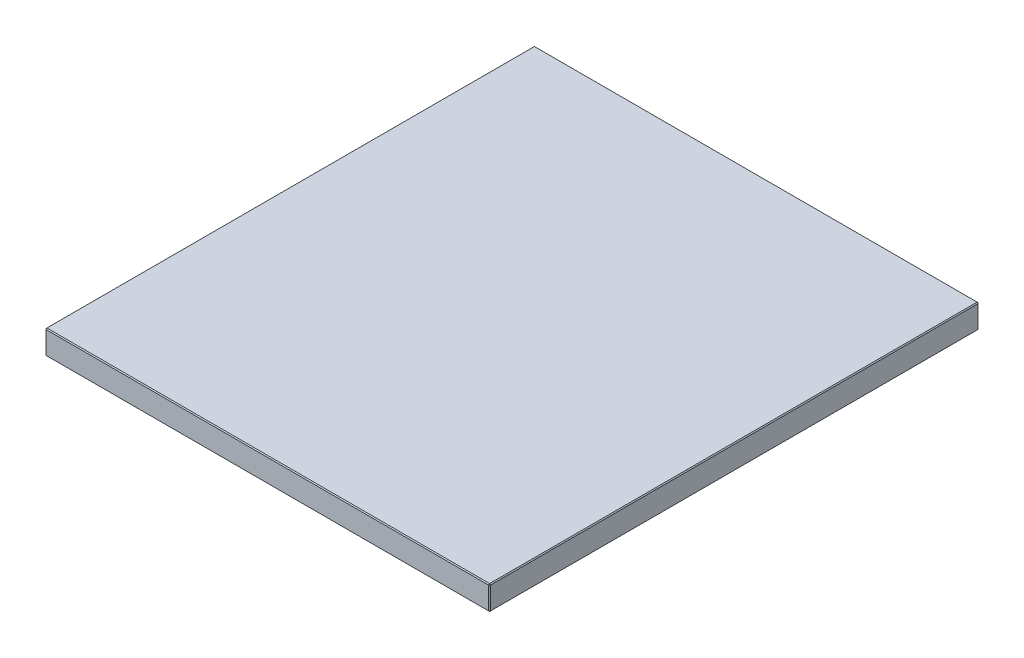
ISO-10303-21;
HEADER;
FILE_DESCRIPTION(('STEP AP214'),'2;1');
FILE_NAME('part.step','',(''),(''),'','','');
FILE_SCHEMA(('AUTOMOTIVE_DESIGN { 1 0 10303 214 1 1 1 1 }'));
ENDSEC;
DATA;
#1=APPLICATION_CONTEXT('core data for automotive mechanical design processes');
#2=APPLICATION_PROTOCOL_DEFINITION('international standard','automotive_design',2000,#1);
#3=PRODUCT_CONTEXT('',#1,'mechanical');
#4=PRODUCT('Part','Part','',(#3));
#5=PRODUCT_RELATED_PRODUCT_CATEGORY('part','',(#4));
#6=PRODUCT_DEFINITION_FORMATION('','',#4);
#7=PRODUCT_DEFINITION_CONTEXT('part definition',#1,'design');
#8=PRODUCT_DEFINITION('design','',#6,#7);
#9=PRODUCT_DEFINITION_SHAPE('','',#8);
#10=(LENGTH_UNIT() NAMED_UNIT(*) SI_UNIT(.MILLI.,.METRE.));
#11=(NAMED_UNIT(*) PLANE_ANGLE_UNIT() SI_UNIT($,.RADIAN.));
#12=(NAMED_UNIT(*) SI_UNIT($,.STERADIAN.) SOLID_ANGLE_UNIT());
#13=UNCERTAINTY_MEASURE_WITH_UNIT(LENGTH_MEASURE(1.E-05),#10,'distance_accuracy_value','');
#14=(GEOMETRIC_REPRESENTATION_CONTEXT(3) GLOBAL_UNCERTAINTY_ASSIGNED_CONTEXT((#13)) GLOBAL_UNIT_ASSIGNED_CONTEXT((#10,
#11,#12)) REPRESENTATION_CONTEXT('',''));
#15=CARTESIAN_POINT('',(0.,0.,0.));
#16=DIRECTION('',(0.,0.,1.));
#17=DIRECTION('',(1.,0.,0.));
#18=AXIS2_PLACEMENT_3D('',#15,#16,#17);
#19=CARTESIAN_POINT('',(-248.,27.,273.));
#20=DIRECTION('',(1.,0.,0.));
#21=DIRECTION('',(0.,0.,-1.));
#22=AXIS2_PLACEMENT_3D('',#19,#20,#21);
#23=PLANE('',#22);
#24=DIRECTION('',(0.,-1.,0.));
#25=VECTOR('',#24,1.);
#26=CARTESIAN_POINT('',(-248.,27.,-272.));
#27=LINE('',#26,#25);
#28=CARTESIAN_POINT('',(-248.,26.,-272.));
#29=VERTEX_POINT('',#28);
#30=CARTESIAN_POINT('',(-248.,1.,-272.));
#31=VERTEX_POINT('',#30);
#32=EDGE_CURVE('E114',#29,#31,#27,.T.);
#33=ORIENTED_EDGE('',*,*,#32,.T.);
#34=DIRECTION('',(0.,0.,1.));
#35=VECTOR('',#34,1.);
#36=CARTESIAN_POINT('',(-248.,1.,273.));
#37=LINE('',#36,#35);
#38=CARTESIAN_POINT('',(-248.,1.,272.));
#39=VERTEX_POINT('',#38);
#40=EDGE_CURVE('E110',#31,#39,#37,.T.);
#41=ORIENTED_EDGE('',*,*,#40,.T.);
#42=DIRECTION('',(0.,1.,0.));
#43=VECTOR('',#42,1.);
#44=CARTESIAN_POINT('',(-248.,27.,272.));
#45=LINE('',#44,#43);
#46=CARTESIAN_POINT('',(-248.,26.,272.));
#47=VERTEX_POINT('',#46);
#48=EDGE_CURVE('E103',#39,#47,#45,.T.);
#49=ORIENTED_EDGE('',*,*,#48,.T.);
#50=DIRECTION('',(0.,0.,-1.));
#51=VECTOR('',#50,1.);
#52=CARTESIAN_POINT('',(-248.,26.,-273.));
#53=LINE('',#52,#51);
#54=EDGE_CURVE('E107',#47,#29,#53,.T.);
#55=ORIENTED_EDGE('',*,*,#54,.T.);
#56=EDGE_LOOP('',(#33,#41,#49,#55));
#57=FACE_BOUND('',#56,.T.);
#58=ADVANCED_FACE('F15',(#57),#23,.F.);
#59=CARTESIAN_POINT('',(248.,27.,273.));
#60=DIRECTION('',(0.,0.,-1.));
#61=DIRECTION('',(-1.,0.,0.));
#62=AXIS2_PLACEMENT_3D('',#59,#60,#61);
#63=PLANE('',#62);
#64=DIRECTION('',(-1.,0.,0.));
#65=VECTOR('',#64,1.);
#66=CARTESIAN_POINT('',(-248.,26.,273.));
#67=LINE('',#66,#65);
#68=CARTESIAN_POINT('',(247.,26.,273.));
#69=VERTEX_POINT('',#68);
#70=CARTESIAN_POINT('',(-247.,26.,273.));
#71=VERTEX_POINT('',#70);
#72=EDGE_CURVE('E164',#69,#71,#67,.T.);
#73=ORIENTED_EDGE('',*,*,#72,.T.);
#74=DIRECTION('',(0.,-1.,0.));
#75=VECTOR('',#74,1.);
#76=CARTESIAN_POINT('',(-247.,27.,273.));
#77=LINE('',#76,#75);
#78=CARTESIAN_POINT('',(-247.,1.,273.));
#79=VERTEX_POINT('',#78);
#80=EDGE_CURVE('E122',#71,#79,#77,.T.);
#81=ORIENTED_EDGE('',*,*,#80,.T.);
#82=DIRECTION('',(1.,0.,0.));
#83=VECTOR('',#82,1.);
#84=CARTESIAN_POINT('',(248.,1.,273.));
#85=LINE('',#84,#83);
#86=CARTESIAN_POINT('',(247.,1.,273.));
#87=VERTEX_POINT('',#86);
#88=EDGE_CURVE('E168',#79,#87,#85,.T.);
#89=ORIENTED_EDGE('',*,*,#88,.T.);
#90=DIRECTION('',(0.,1.,0.));
#91=VECTOR('',#90,1.);
#92=CARTESIAN_POINT('',(247.,27.,273.));
#93=LINE('',#92,#91);
#94=EDGE_CURVE('E166',#87,#69,#93,.T.);
#95=ORIENTED_EDGE('',*,*,#94,.T.);
#96=EDGE_LOOP('',(#73,#81,#89,#95));
#97=FACE_BOUND('',#96,.T.);
#98=ADVANCED_FACE('F275',(#97),#63,.F.);
#99=CARTESIAN_POINT('',(248.,27.,273.));
#100=DIRECTION('',(-1.,0.,0.));
#101=DIRECTION('',(0.,0.,1.));
#102=AXIS2_PLACEMENT_3D('',#99,#100,#101);
#103=PLANE('',#102);
#104=DIRECTION('',(0.,0.,-1.));
#105=VECTOR('',#104,1.);
#106=CARTESIAN_POINT('',(248.,1.,273.));
#107=LINE('',#106,#105);
#108=CARTESIAN_POINT('',(248.,1.,272.));
#109=VERTEX_POINT('',#108);
#110=CARTESIAN_POINT('',(248.,1.,-272.));
#111=VERTEX_POINT('',#110);
#112=EDGE_CURVE('E159',#109,#111,#107,.T.);
#113=ORIENTED_EDGE('',*,*,#112,.T.);
#114=DIRECTION('',(0.,1.,0.));
#115=VECTOR('',#114,1.);
#116=CARTESIAN_POINT('',(248.,27.,-272.));
#117=LINE('',#116,#115);
#118=CARTESIAN_POINT('',(248.,26.,-272.));
#119=VERTEX_POINT('',#118);
#120=EDGE_CURVE('E161',#111,#119,#117,.T.);
#121=ORIENTED_EDGE('',*,*,#120,.T.);
#122=DIRECTION('',(0.,0.,1.));
#123=VECTOR('',#122,1.);
#124=CARTESIAN_POINT('',(248.,26.,273.));
#125=LINE('',#124,#123);
#126=CARTESIAN_POINT('',(248.,26.,272.));
#127=VERTEX_POINT('',#126);
#128=EDGE_CURVE('E155',#119,#127,#125,.T.);
#129=ORIENTED_EDGE('',*,*,#128,.T.);
#130=DIRECTION('',(0.,-1.,0.));
#131=VECTOR('',#130,1.);
#132=CARTESIAN_POINT('',(248.,27.,272.));
#133=LINE('',#132,#131);
#134=EDGE_CURVE('E157',#127,#109,#133,.T.);
#135=ORIENTED_EDGE('',*,*,#134,.T.);
#136=EDGE_LOOP('',(#113,#121,#129,#135));
#137=FACE_BOUND('',#136,.T.);
#138=ADVANCED_FACE('F254',(#137),#103,.F.);
#139=CARTESIAN_POINT('',(248.,27.,-273.));
#140=DIRECTION('',(0.,0.,1.));
#141=DIRECTION('',(1.,0.,0.));
#142=AXIS2_PLACEMENT_3D('',#139,#140,#141);
#143=PLANE('',#142);
#144=DIRECTION('',(0.,-1.,0.));
#145=VECTOR('',#144,1.);
#146=CARTESIAN_POINT('',(247.,27.,-273.));
#147=LINE('',#146,#145);
#148=CARTESIAN_POINT('',(247.,26.,-273.));
#149=VERTEX_POINT('',#148);
#150=CARTESIAN_POINT('',(247.,1.,-273.));
#151=VERTEX_POINT('',#150);
#152=EDGE_CURVE('E148',#149,#151,#147,.T.);
#153=ORIENTED_EDGE('',*,*,#152,.T.);
#154=DIRECTION('',(-1.,0.,0.));
#155=VECTOR('',#154,1.);
#156=CARTESIAN_POINT('',(248.,1.,-273.));
#157=LINE('',#156,#155);
#158=CARTESIAN_POINT('',(-247.,1.,-273.));
#159=VERTEX_POINT('',#158);
#160=EDGE_CURVE('E153',#151,#159,#157,.T.);
#161=ORIENTED_EDGE('',*,*,#160,.T.);
#162=DIRECTION('',(0.,1.,0.));
#163=VECTOR('',#162,1.);
#164=CARTESIAN_POINT('',(-247.,27.,-273.));
#165=LINE('',#164,#163);
#166=CARTESIAN_POINT('',(-247.,26.,-273.));
#167=VERTEX_POINT('',#166);
#168=EDGE_CURVE('E150',#159,#167,#165,.T.);
#169=ORIENTED_EDGE('',*,*,#168,.T.);
#170=DIRECTION('',(1.,0.,0.));
#171=VECTOR('',#170,1.);
#172=CARTESIAN_POINT('',(248.,26.,-273.));
#173=LINE('',#172,#171);
#174=EDGE_CURVE('E146',#167,#149,#173,.T.);
#175=ORIENTED_EDGE('',*,*,#174,.T.);
#176=EDGE_LOOP('',(#153,#161,#169,#175));
#177=FACE_BOUND('',#176,.T.);
#178=ADVANCED_FACE('F284',(#177),#143,.F.);
#179=CARTESIAN_POINT('',(0.,27.,0.));
#180=DIRECTION('',(0.,1.,0.));
#181=DIRECTION('',(0.,0.,1.));
#182=AXIS2_PLACEMENT_3D('',#179,#180,#181);
#183=PLANE('',#182);
#184=DIRECTION('',(0.,0.,-1.));
#185=VECTOR('',#184,1.);
#186=CARTESIAN_POINT('',(247.,27.,-273.));
#187=LINE('',#186,#185);
#188=CARTESIAN_POINT('',(247.,27.,272.));
#189=VERTEX_POINT('',#188);
#190=CARTESIAN_POINT('',(247.,27.,-272.));
#191=VERTEX_POINT('',#190);
#192=EDGE_CURVE('E24',#189,#191,#187,.T.);
#193=ORIENTED_EDGE('',*,*,#192,.T.);
#194=DIRECTION('',(-1.,0.,0.));
#195=VECTOR('',#194,1.);
#196=CARTESIAN_POINT('',(-248.,27.,-272.));
#197=LINE('',#196,#195);
#198=CARTESIAN_POINT('',(-247.,27.,-272.));
#199=VERTEX_POINT('',#198);
#200=EDGE_CURVE('E9',#191,#199,#197,.T.);
#201=ORIENTED_EDGE('',*,*,#200,.T.);
#202=DIRECTION('',(0.,0.,1.));
#203=VECTOR('',#202,1.);
#204=CARTESIAN_POINT('',(-247.,27.,273.));
#205=LINE('',#204,#203);
#206=CARTESIAN_POINT('',(-247.,27.,272.));
#207=VERTEX_POINT('',#206);
#208=EDGE_CURVE('E180',#199,#207,#205,.T.);
#209=ORIENTED_EDGE('',*,*,#208,.T.);
#210=DIRECTION('',(1.,0.,0.));
#211=VECTOR('',#210,1.);
#212=CARTESIAN_POINT('',(248.,27.,272.));
#213=LINE('',#212,#211);
#214=EDGE_CURVE('E35',#207,#189,#213,.T.);
#215=ORIENTED_EDGE('',*,*,#214,.T.);
#216=EDGE_LOOP('',(#193,#201,#209,#215));
#217=FACE_BOUND('',#216,.T.);
#218=ADVANCED_FACE('F350',(#217),#183,.T.);
#219=CARTESIAN_POINT('',(0.,0.,0.));
#220=DIRECTION('',(0.,1.,0.));
#221=DIRECTION('',(0.,0.,1.));
#222=AXIS2_PLACEMENT_3D('',#219,#220,#221);
#223=PLANE('',#222);
#224=DIRECTION('',(0.,0.,1.));
#225=VECTOR('',#224,1.);
#226=CARTESIAN_POINT('',(247.,0.,0.));
#227=LINE('',#226,#225);
#228=CARTESIAN_POINT('',(247.,0.,-272.));
#229=VERTEX_POINT('',#228);
#230=CARTESIAN_POINT('',(247.,0.,272.));
#231=VERTEX_POINT('',#230);
#232=EDGE_CURVE('E171',#229,#231,#227,.T.);
#233=ORIENTED_EDGE('',*,*,#232,.T.);
#234=DIRECTION('',(-1.,0.,0.));
#235=VECTOR('',#234,1.);
#236=CARTESIAN_POINT('',(0.,0.,272.));
#237=LINE('',#236,#235);
#238=CARTESIAN_POINT('',(-247.,0.,272.));
#239=VERTEX_POINT('',#238);
#240=EDGE_CURVE('E177',#231,#239,#237,.T.);
#241=ORIENTED_EDGE('',*,*,#240,.T.);
#242=DIRECTION('',(0.,0.,-1.));
#243=VECTOR('',#242,1.);
#244=CARTESIAN_POINT('',(-247.,0.,0.));
#245=LINE('',#244,#243);
#246=CARTESIAN_POINT('',(-247.,0.,-272.));
#247=VERTEX_POINT('',#246);
#248=EDGE_CURVE('E175',#239,#247,#245,.T.);
#249=ORIENTED_EDGE('',*,*,#248,.T.);
#250=DIRECTION('',(1.,0.,0.));
#251=VECTOR('',#250,1.);
#252=CARTESIAN_POINT('',(0.,0.,-272.));
#253=LINE('',#252,#251);
#254=EDGE_CURVE('E173',#247,#229,#253,.T.);
#255=ORIENTED_EDGE('',*,*,#254,.T.);
#256=EDGE_LOOP('',(#233,#241,#249,#255));
#257=FACE_BOUND('',#256,.T.);
#258=ADVANCED_FACE('F246',(#257),#223,.F.);
#259=CARTESIAN_POINT('',(248.,27.,272.));
#260=DIRECTION('',(-0.707106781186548,0.,-0.707106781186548));
#261=DIRECTION('',(0.,-1.,0.));
#262=AXIS2_PLACEMENT_3D('',#259,#260,#261);
#263=PLANE('',#262);
#264=DIRECTION('',(-0.707106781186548,0.,0.707106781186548));
#265=VECTOR('',#264,1.);
#266=CARTESIAN_POINT('',(247.,26.,273.));
#267=LINE('',#266,#265);
#268=EDGE_CURVE('E19',#69,#127,#267,.F.);
#269=ORIENTED_EDGE('',*,*,#268,.F.);
#270=ORIENTED_EDGE('',*,*,#94,.F.);
#271=DIRECTION('',(0.707106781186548,0.,-0.707106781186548));
#272=VECTOR('',#271,1.);
#273=CARTESIAN_POINT('',(247.,1.,273.));
#274=LINE('',#273,#272);
#275=EDGE_CURVE('E142',#109,#87,#274,.F.);
#276=ORIENTED_EDGE('',*,*,#275,.F.);
#277=ORIENTED_EDGE('',*,*,#134,.F.);
#278=EDGE_LOOP('',(#269,#270,#276,#277));
#279=FACE_BOUND('',#278,.T.);
#280=ADVANCED_FACE('F17',(#279),#263,.F.);
#281=CARTESIAN_POINT('',(247.,26.,273.));
#282=DIRECTION('',(0.577350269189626,0.577350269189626,0.577350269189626));
#283=DIRECTION('',(0.707106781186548,0.,-0.707106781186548));
#284=AXIS2_PLACEMENT_3D('',#281,#282,#283);
#285=PLANE('',#284);
#286=DIRECTION('',(0.,-0.707106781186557,0.707106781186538));
#287=VECTOR('',#286,1.);
#288=CARTESIAN_POINT('',(247.,26.,273.));
#289=LINE('',#288,#287);
#290=EDGE_CURVE('E226',#69,#189,#289,.F.);
#291=ORIENTED_EDGE('',*,*,#290,.F.);
#292=ORIENTED_EDGE('',*,*,#268,.T.);
#293=DIRECTION('',(-0.707106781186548,0.707106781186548,0.));
#294=VECTOR('',#293,1.);
#295=CARTESIAN_POINT('',(247.5,26.5,272.));
#296=LINE('',#295,#294);
#297=EDGE_CURVE('E228',#189,#127,#296,.F.);
#298=ORIENTED_EDGE('',*,*,#297,.F.);
#299=EDGE_LOOP('',(#291,#292,#298));
#300=FACE_BOUND('',#299,.T.);
#301=ADVANCED_FACE('F270',(#300),#285,.T.);
#302=CARTESIAN_POINT('',(247.,1.,273.));
#303=DIRECTION('',(0.577350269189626,-0.577350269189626,0.577350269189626));
#304=DIRECTION('',(0.707106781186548,0.,-0.707106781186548));
#305=AXIS2_PLACEMENT_3D('',#302,#303,#304);
#306=PLANE('',#305);
#307=DIRECTION('',(-0.707106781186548,-0.707106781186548,0.));
#308=VECTOR('',#307,1.);
#309=CARTESIAN_POINT('',(247.5,0.5,272.));
#310=LINE('',#309,#308);
#311=EDGE_CURVE('E220',#109,#231,#310,.T.);
#312=ORIENTED_EDGE('',*,*,#311,.F.);
#313=ORIENTED_EDGE('',*,*,#275,.T.);
#314=DIRECTION('',(0.,0.707106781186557,0.707106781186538));
#315=VECTOR('',#314,1.);
#316=CARTESIAN_POINT('',(247.,1.,273.));
#317=LINE('',#316,#315);
#318=EDGE_CURVE('E223',#231,#87,#317,.T.);
#319=ORIENTED_EDGE('',*,*,#318,.F.);
#320=EDGE_LOOP('',(#312,#313,#319));
#321=FACE_BOUND('',#320,.T.);
#322=ADVANCED_FACE('F235',(#321),#306,.T.);
#323=CARTESIAN_POINT('',(247.,27.,0.));
#324=DIRECTION('',(0.707106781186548,0.707106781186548,0.));
#325=DIRECTION('',(0.,0.,1.));
#326=AXIS2_PLACEMENT_3D('',#323,#324,#325);
#327=PLANE('',#326);
#328=ORIENTED_EDGE('',*,*,#297,.T.);
#329=ORIENTED_EDGE('',*,*,#128,.F.);
#330=DIRECTION('',(0.707106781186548,-0.707106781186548,0.));
#331=VECTOR('',#330,1.);
#332=CARTESIAN_POINT('',(248.,26.,-272.));
#333=LINE('',#332,#331);
#334=EDGE_CURVE('E215',#191,#119,#333,.T.);
#335=ORIENTED_EDGE('',*,*,#334,.F.);
#336=ORIENTED_EDGE('',*,*,#192,.F.);
#337=EDGE_LOOP('',(#328,#329,#335,#336));
#338=FACE_BOUND('',#337,.T.);
#339=ADVANCED_FACE('F265',(#338),#327,.T.);
#340=CARTESIAN_POINT('',(0.,27.,272.));
#341=DIRECTION('',(0.,0.707106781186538,0.707106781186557));
#342=DIRECTION('',(-1.,0.,0.));
#343=AXIS2_PLACEMENT_3D('',#340,#341,#342);
#344=PLANE('',#343);
#345=ORIENTED_EDGE('',*,*,#290,.T.);
#346=ORIENTED_EDGE('',*,*,#214,.F.);
#347=DIRECTION('',(0.,0.707106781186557,-0.707106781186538));
#348=VECTOR('',#347,1.);
#349=CARTESIAN_POINT('',(-247.,26.5,272.5));
#350=LINE('',#349,#348);
#351=EDGE_CURVE('E126',#71,#207,#350,.T.);
#352=ORIENTED_EDGE('',*,*,#351,.F.);
#353=ORIENTED_EDGE('',*,*,#72,.F.);
#354=EDGE_LOOP('',(#345,#346,#352,#353));
#355=FACE_BOUND('',#354,.T.);
#356=ADVANCED_FACE('F273',(#355),#344,.T.);
#357=CARTESIAN_POINT('',(-247.,27.,273.));
#358=DIRECTION('',(0.707106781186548,0.,-0.707106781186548));
#359=DIRECTION('',(0.,-1.,0.));
#360=AXIS2_PLACEMENT_3D('',#357,#358,#359);
#361=PLANE('',#360);
#362=DIRECTION('',(0.707106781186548,0.,0.707106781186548));
#363=VECTOR('',#362,1.);
#364=CARTESIAN_POINT('',(-247.,1.,273.));
#365=LINE('',#364,#363);
#366=EDGE_CURVE('E127',#79,#39,#365,.F.);
#367=ORIENTED_EDGE('',*,*,#366,.F.);
#368=ORIENTED_EDGE('',*,*,#80,.F.);
#369=DIRECTION('',(-0.707106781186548,0.,-0.707106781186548));
#370=VECTOR('',#369,1.);
#371=CARTESIAN_POINT('',(-248.,26.,272.));
#372=LINE('',#371,#370);
#373=EDGE_CURVE('E118',#47,#71,#372,.F.);
#374=ORIENTED_EDGE('',*,*,#373,.F.);
#375=ORIENTED_EDGE('',*,*,#48,.F.);
#376=EDGE_LOOP('',(#367,#368,#374,#375));
#377=FACE_BOUND('',#376,.T.);
#378=ADVANCED_FACE('F120',(#377),#361,.F.);
#379=CARTESIAN_POINT('',(248.,1.,273.));
#380=DIRECTION('',(0.,0.707106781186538,-0.707106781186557));
#381=DIRECTION('',(1.,0.,0.));
#382=AXIS2_PLACEMENT_3D('',#379,#380,#381);
#383=PLANE('',#382);
#384=ORIENTED_EDGE('',*,*,#318,.T.);
#385=ORIENTED_EDGE('',*,*,#88,.F.);
#386=DIRECTION('',(0.,-0.707106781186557,-0.707106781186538));
#387=VECTOR('',#386,1.);
#388=CARTESIAN_POINT('',(-247.,1.,273.));
#389=LINE('',#388,#387);
#390=EDGE_CURVE('E211',#239,#79,#389,.F.);
#391=ORIENTED_EDGE('',*,*,#390,.F.);
#392=ORIENTED_EDGE('',*,*,#240,.F.);
#393=EDGE_LOOP('',(#384,#385,#391,#392));
#394=FACE_BOUND('',#393,.T.);
#395=ADVANCED_FACE('F243',(#394),#383,.F.);
#396=CARTESIAN_POINT('',(248.,1.,273.));
#397=DIRECTION('',(-0.707106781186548,0.707106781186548,0.));
#398=DIRECTION('',(0.,0.,-1.));
#399=AXIS2_PLACEMENT_3D('',#396,#397,#398);
#400=PLANE('',#399);
#401=ORIENTED_EDGE('',*,*,#311,.T.);
#402=ORIENTED_EDGE('',*,*,#232,.F.);
#403=DIRECTION('',(0.707106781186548,0.707106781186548,0.));
#404=VECTOR('',#403,1.);
#405=CARTESIAN_POINT('',(247.5,0.500000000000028,-272.));
#406=LINE('',#405,#404);
#407=EDGE_CURVE('E208',#111,#229,#406,.F.);
#408=ORIENTED_EDGE('',*,*,#407,.F.);
#409=ORIENTED_EDGE('',*,*,#112,.F.);
#410=EDGE_LOOP('',(#401,#402,#408,#409));
#411=FACE_BOUND('',#410,.T.);
#412=ADVANCED_FACE('F251',(#411),#400,.F.);
#413=CARTESIAN_POINT('',(247.,27.,-273.));
#414=DIRECTION('',(-0.707106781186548,0.,0.707106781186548));
#415=DIRECTION('',(0.,-1.,0.));
#416=AXIS2_PLACEMENT_3D('',#413,#414,#415);
#417=PLANE('',#416);
#418=DIRECTION('',(0.707106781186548,0.,0.707106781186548));
#419=VECTOR('',#418,1.);
#420=CARTESIAN_POINT('',(248.,26.,-272.));
#421=LINE('',#420,#419);
#422=EDGE_CURVE('E217',#119,#149,#421,.F.);
#423=ORIENTED_EDGE('',*,*,#422,.F.);
#424=ORIENTED_EDGE('',*,*,#120,.F.);
#425=DIRECTION('',(-0.707106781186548,0.,-0.707106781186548));
#426=VECTOR('',#425,1.);
#427=CARTESIAN_POINT('',(247.,1.,-273.));
#428=LINE('',#427,#426);
#429=EDGE_CURVE('E205',#151,#111,#428,.F.);
#430=ORIENTED_EDGE('',*,*,#429,.F.);
#431=ORIENTED_EDGE('',*,*,#152,.F.);
#432=EDGE_LOOP('',(#423,#424,#430,#431));
#433=FACE_BOUND('',#432,.T.);
#434=ADVANCED_FACE('F258',(#433),#417,.F.);
#435=CARTESIAN_POINT('',(248.,26.,-272.));
#436=DIRECTION('',(0.577350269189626,0.577350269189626,-0.577350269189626));
#437=DIRECTION('',(-0.707106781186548,0.,-0.707106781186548));
#438=AXIS2_PLACEMENT_3D('',#435,#436,#437);
#439=PLANE('',#438);
#440=ORIENTED_EDGE('',*,*,#334,.T.);
#441=ORIENTED_EDGE('',*,*,#422,.T.);
#442=DIRECTION('',(0.,0.707106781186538,0.707106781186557));
#443=VECTOR('',#442,1.);
#444=CARTESIAN_POINT('',(247.,26.5,-272.5));
#445=LINE('',#444,#443);
#446=EDGE_CURVE('E134',#191,#149,#445,.F.);
#447=ORIENTED_EDGE('',*,*,#446,.F.);
#448=EDGE_LOOP('',(#440,#441,#447));
#449=FACE_BOUND('',#448,.T.);
#450=ADVANCED_FACE('F325',(#449),#439,.T.);
#451=CARTESIAN_POINT('',(-248.,26.,272.));
#452=DIRECTION('',(-0.577350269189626,0.577350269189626,0.577350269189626));
#453=DIRECTION('',(0.707106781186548,0.,0.707106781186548));
#454=AXIS2_PLACEMENT_3D('',#451,#452,#453);
#455=PLANE('',#454);
#456=ORIENTED_EDGE('',*,*,#373,.T.);
#457=ORIENTED_EDGE('',*,*,#351,.T.);
#458=DIRECTION('',(-0.707106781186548,-0.707106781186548,0.));
#459=VECTOR('',#458,1.);
#460=CARTESIAN_POINT('',(-248.,26.,272.));
#461=LINE('',#460,#459);
#462=EDGE_CURVE('E130',#47,#207,#461,.F.);
#463=ORIENTED_EDGE('',*,*,#462,.F.);
#464=EDGE_LOOP('',(#456,#457,#463));
#465=FACE_BOUND('',#464,.T.);
#466=ADVANCED_FACE('F131',(#465),#455,.T.);
#467=CARTESIAN_POINT('',(-247.,1.,273.));
#468=DIRECTION('',(-0.577350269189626,-0.577350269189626,0.577350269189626));
#469=DIRECTION('',(0.707106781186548,0.,0.707106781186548));
#470=AXIS2_PLACEMENT_3D('',#467,#468,#469);
#471=PLANE('',#470);
#472=ORIENTED_EDGE('',*,*,#390,.T.);
#473=ORIENTED_EDGE('',*,*,#366,.T.);
#474=DIRECTION('',(-0.707106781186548,0.707106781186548,0.));
#475=VECTOR('',#474,1.);
#476=CARTESIAN_POINT('',(-247.5,0.5,272.));
#477=LINE('',#476,#475);
#478=EDGE_CURVE('E135',#239,#39,#477,.T.);
#479=ORIENTED_EDGE('',*,*,#478,.F.);
#480=EDGE_LOOP('',(#472,#473,#479));
#481=FACE_BOUND('',#480,.T.);
#482=ADVANCED_FACE('F318',(#481),#471,.T.);
#483=CARTESIAN_POINT('',(247.,1.,-273.));
#484=DIRECTION('',(0.577350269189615,-0.577350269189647,-0.577350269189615));
#485=DIRECTION('',(0.,0.707106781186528,-0.707106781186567));
#486=AXIS2_PLACEMENT_3D('',#483,#484,#485);
#487=PLANE('',#486);
#488=ORIENTED_EDGE('',*,*,#429,.T.);
#489=ORIENTED_EDGE('',*,*,#407,.T.);
#490=DIRECTION('',(0.,-0.707106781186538,0.707106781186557));
#491=VECTOR('',#490,1.);
#492=CARTESIAN_POINT('',(247.,1.,-273.));
#493=LINE('',#492,#491);
#494=EDGE_CURVE('E198',#151,#229,#493,.T.);
#495=ORIENTED_EDGE('',*,*,#494,.F.);
#496=EDGE_LOOP('',(#488,#489,#495));
#497=FACE_BOUND('',#496,.T.);
#498=ADVANCED_FACE('F314',(#497),#487,.T.);
#499=CARTESIAN_POINT('',(0.,27.,-272.));
#500=DIRECTION('',(0.,0.707106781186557,-0.707106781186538));
#501=DIRECTION('',(1.,0.,0.));
#502=AXIS2_PLACEMENT_3D('',#499,#500,#501);
#503=PLANE('',#502);
#504=ORIENTED_EDGE('',*,*,#446,.T.);
#505=ORIENTED_EDGE('',*,*,#174,.F.);
#506=DIRECTION('',(0.,-0.707106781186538,-0.707106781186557));
#507=VECTOR('',#506,1.);
#508=CARTESIAN_POINT('',(-247.,26.,-273.));
#509=LINE('',#508,#507);
#510=EDGE_CURVE('E195',#199,#167,#509,.T.);
#511=ORIENTED_EDGE('',*,*,#510,.F.);
#512=ORIENTED_EDGE('',*,*,#200,.F.);
#513=EDGE_LOOP('',(#504,#505,#511,#512));
#514=FACE_BOUND('',#513,.T.);
#515=ADVANCED_FACE('F311',(#514),#503,.T.);
#516=CARTESIAN_POINT('',(-247.,27.,0.));
#517=DIRECTION('',(-0.707106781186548,0.707106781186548,0.));
#518=DIRECTION('',(0.,0.,-1.));
#519=AXIS2_PLACEMENT_3D('',#516,#517,#518);
#520=PLANE('',#519);
#521=ORIENTED_EDGE('',*,*,#462,.T.);
#522=ORIENTED_EDGE('',*,*,#208,.F.);
#523=DIRECTION('',(0.707106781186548,0.707106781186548,0.));
#524=VECTOR('',#523,1.);
#525=CARTESIAN_POINT('',(-247.5,26.5,-272.));
#526=LINE('',#525,#524);
#527=EDGE_CURVE('E138',#29,#199,#526,.T.);
#528=ORIENTED_EDGE('',*,*,#527,.F.);
#529=ORIENTED_EDGE('',*,*,#54,.F.);
#530=EDGE_LOOP('',(#521,#522,#528,#529));
#531=FACE_BOUND('',#530,.T.);
#532=ADVANCED_FACE('F137',(#531),#520,.T.);
#533=CARTESIAN_POINT('',(-248.,1.,273.));
#534=DIRECTION('',(0.707106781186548,0.707106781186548,0.));
#535=DIRECTION('',(0.,0.,1.));
#536=AXIS2_PLACEMENT_3D('',#533,#534,#535);
#537=PLANE('',#536);
#538=ORIENTED_EDGE('',*,*,#478,.T.);
#539=ORIENTED_EDGE('',*,*,#40,.F.);
#540=DIRECTION('',(0.707106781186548,-0.707106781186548,1.17611407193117E-13));
#541=VECTOR('',#540,1.);
#542=CARTESIAN_POINT('',(-248.,1.,-272.));
#543=LINE('',#542,#541);
#544=EDGE_CURVE('E191',#247,#31,#543,.F.);
#545=ORIENTED_EDGE('',*,*,#544,.F.);
#546=ORIENTED_EDGE('',*,*,#248,.F.);
#547=EDGE_LOOP('',(#538,#539,#545,#546));
#548=FACE_BOUND('',#547,.T.);
#549=ADVANCED_FACE('F304',(#548),#537,.F.);
#550=CARTESIAN_POINT('',(248.,1.,-273.));
#551=DIRECTION('',(0.,0.707106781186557,0.707106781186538));
#552=DIRECTION('',(-1.,0.,0.));
#553=AXIS2_PLACEMENT_3D('',#550,#551,#552);
#554=PLANE('',#553);
#555=ORIENTED_EDGE('',*,*,#494,.T.);
#556=ORIENTED_EDGE('',*,*,#254,.F.);
#557=DIRECTION('',(0.,0.707106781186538,-0.707106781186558));
#558=VECTOR('',#557,1.);
#559=CARTESIAN_POINT('',(-247.,0.50000000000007,-272.5));
#560=LINE('',#559,#558);
#561=EDGE_CURVE('E188',#159,#247,#560,.F.);
#562=ORIENTED_EDGE('',*,*,#561,.F.);
#563=ORIENTED_EDGE('',*,*,#160,.F.);
#564=EDGE_LOOP('',(#555,#556,#562,#563));
#565=FACE_BOUND('',#564,.T.);
#566=ADVANCED_FACE('F300',(#565),#554,.F.);
#567=CARTESIAN_POINT('',(-247.,26.,-273.));
#568=DIRECTION('',(-0.577350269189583,0.577350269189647,-0.577350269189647));
#569=DIRECTION('',(0.,0.707106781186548,0.707106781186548));
#570=AXIS2_PLACEMENT_3D('',#567,#568,#569);
#571=PLANE('',#570);
#572=ORIENTED_EDGE('',*,*,#527,.T.);
#573=ORIENTED_EDGE('',*,*,#510,.T.);
#574=DIRECTION('',(0.707106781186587,0.,-0.707106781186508));
#575=VECTOR('',#574,1.);
#576=CARTESIAN_POINT('',(-247.,26.,-273.));
#577=LINE('',#576,#575);
#578=EDGE_CURVE('E186',#29,#167,#577,.T.);
#579=ORIENTED_EDGE('',*,*,#578,.F.);
#580=EDGE_LOOP('',(#572,#573,#579));
#581=FACE_BOUND('',#580,.T.);
#582=ADVANCED_FACE('F296',(#581),#571,.T.);
#583=CARTESIAN_POINT('',(-248.,1.,-272.));
#584=DIRECTION('',(-0.577350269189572,-0.577350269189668,-0.577350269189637));
#585=DIRECTION('',(0.,0.707106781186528,-0.707106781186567));
#586=AXIS2_PLACEMENT_3D('',#583,#584,#585);
#587=PLANE('',#586);
#588=ORIENTED_EDGE('',*,*,#561,.T.);
#589=ORIENTED_EDGE('',*,*,#544,.T.);
#590=DIRECTION('',(-0.707106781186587,0.,0.707106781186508));
#591=VECTOR('',#590,1.);
#592=CARTESIAN_POINT('',(-248.,1.,-272.));
#593=LINE('',#592,#591);
#594=EDGE_CURVE('E184',#159,#31,#593,.T.);
#595=ORIENTED_EDGE('',*,*,#594,.F.);
#596=EDGE_LOOP('',(#588,#589,#595));
#597=FACE_BOUND('',#596,.T.);
#598=ADVANCED_FACE('F292',(#597),#587,.T.);
#599=CARTESIAN_POINT('',(-248.,27.,-272.));
#600=DIRECTION('',(0.707106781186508,0.,0.707106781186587));
#601=DIRECTION('',(0.,-1.,0.));
#602=AXIS2_PLACEMENT_3D('',#599,#600,#601);
#603=PLANE('',#602);
#604=ORIENTED_EDGE('',*,*,#578,.T.);
#605=ORIENTED_EDGE('',*,*,#168,.F.);
#606=ORIENTED_EDGE('',*,*,#594,.T.);
#607=ORIENTED_EDGE('',*,*,#32,.F.);
#608=EDGE_LOOP('',(#604,#605,#606,#607));
#609=FACE_BOUND('',#608,.T.);
#610=ADVANCED_FACE('F289',(#609),#603,.F.);
#611=CLOSED_SHELL('',(#58,#98,#138,#178,#218,#258,#280,#301,#322,#339,#356,#378,#395,#412,#434,
#450,#466,#482,#498,#515,#532,#549,#566,#582,#598,#610));
#612=MANIFOLD_SOLID_BREP('B1',#611);
#613=ADVANCED_BREP_SHAPE_REPRESENTATION('',(#18,#612),#14);
#614=SHAPE_DEFINITION_REPRESENTATION(#9,#613);
ENDSEC;
END-ISO-10303-21;
